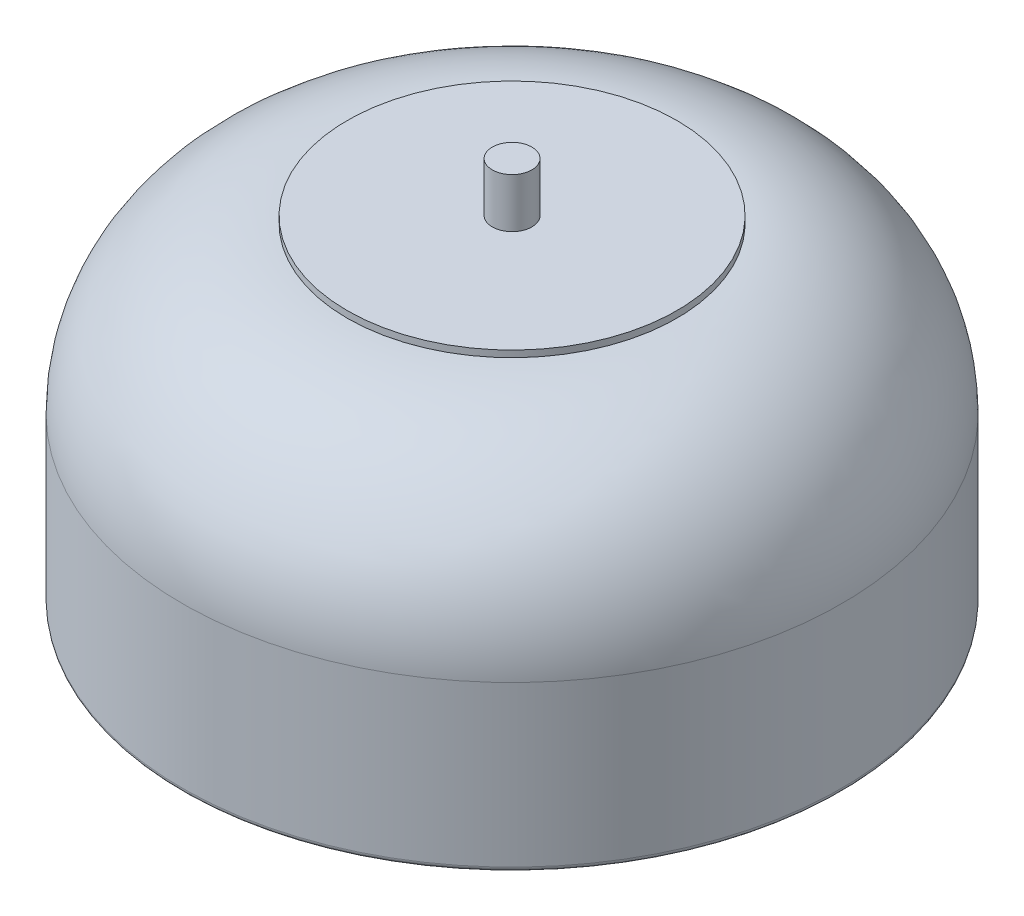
ISO-10303-21;
HEADER;
FILE_DESCRIPTION(('STEP AP214'),'2;1');
FILE_NAME('part.step','',(''),(''),'','','');
FILE_SCHEMA(('AUTOMOTIVE_DESIGN { 1 0 10303 214 1 1 1 1 }'));
ENDSEC;
DATA;
#1=APPLICATION_CONTEXT('core data for automotive mechanical design processes');
#2=APPLICATION_PROTOCOL_DEFINITION('international standard','automotive_design',2000,#1);
#3=PRODUCT_CONTEXT('',#1,'mechanical');
#4=PRODUCT('Part','Part','',(#3));
#5=PRODUCT_RELATED_PRODUCT_CATEGORY('part','',(#4));
#6=PRODUCT_DEFINITION_FORMATION('','',#4);
#7=PRODUCT_DEFINITION_CONTEXT('part definition',#1,'design');
#8=PRODUCT_DEFINITION('design','',#6,#7);
#9=PRODUCT_DEFINITION_SHAPE('','',#8);
#10=(LENGTH_UNIT() NAMED_UNIT(*) SI_UNIT(.MILLI.,.METRE.));
#11=(NAMED_UNIT(*) PLANE_ANGLE_UNIT() SI_UNIT($,.RADIAN.));
#12=(NAMED_UNIT(*) SI_UNIT($,.STERADIAN.) SOLID_ANGLE_UNIT());
#13=UNCERTAINTY_MEASURE_WITH_UNIT(LENGTH_MEASURE(1.E-05),#10,'distance_accuracy_value','');
#14=(GEOMETRIC_REPRESENTATION_CONTEXT(3) GLOBAL_UNCERTAINTY_ASSIGNED_CONTEXT((#13)) GLOBAL_UNIT_ASSIGNED_CONTEXT((#10,
#11,#12)) REPRESENTATION_CONTEXT('',''));
#15=CARTESIAN_POINT('',(0.,0.,0.));
#16=DIRECTION('',(0.,0.,1.));
#17=DIRECTION('',(1.,0.,0.));
#18=AXIS2_PLACEMENT_3D('',#15,#16,#17);
#19=CARTESIAN_POINT('',(0.,32.,0.));
#20=DIRECTION('',(0.,-1.,0.));
#21=DIRECTION('',(0.,0.,-1.));
#22=AXIS2_PLACEMENT_3D('',#19,#20,#21);
#23=CYLINDRICAL_SURFACE('',#22,50.);
#24=CARTESIAN_POINT('',(0.,32.,0.));
#25=DIRECTION('',(0.,1.,0.));
#26=DIRECTION('',(0.,0.,1.));
#27=AXIS2_PLACEMENT_3D('',#24,#25,#26);
#28=CIRCLE('',#27,50.);
#29=CARTESIAN_POINT('',(0.,32.,50.));
#30=VERTEX_POINT('',#29);
#31=EDGE_CURVE('E11',#30,#30,#28,.T.);
#32=ORIENTED_EDGE('',*,*,#31,.F.);
#33=EDGE_LOOP('',(#32));
#34=FACE_BOUND('',#33,.T.);
#35=CARTESIAN_POINT('',(0.,30.,0.));
#36=DIRECTION('',(0.,1.,0.));
#37=DIRECTION('',(0.,0.,1.));
#38=AXIS2_PLACEMENT_3D('',#35,#36,#37);
#39=CIRCLE('',#38,50.);
#40=CARTESIAN_POINT('',(0.,30.,50.));
#41=VERTEX_POINT('',#40);
#42=EDGE_CURVE('E43',#41,#41,#39,.T.);
#43=ORIENTED_EDGE('',*,*,#42,.T.);
#44=EDGE_LOOP('',(#43));
#45=FACE_BOUND('',#44,.T.);
#46=ADVANCED_FACE('F40',(#34,#45),#23,.T.);
#47=CARTESIAN_POINT('',(0.,32.,0.));
#48=DIRECTION('',(0.,1.,0.));
#49=DIRECTION('',(0.,0.,1.));
#50=AXIS2_PLACEMENT_3D('',#47,#48,#49);
#51=PLANE('',#50);
#52=CARTESIAN_POINT('',(0.,32.,0.));
#53=DIRECTION('',(0.,1.,0.));
#54=DIRECTION('',(0.,0.,1.));
#55=AXIS2_PLACEMENT_3D('',#52,#53,#54);
#56=CIRCLE('',#55,6.);
#57=CARTESIAN_POINT('',(0.,32.,6.));
#58=VERTEX_POINT('',#57);
#59=EDGE_CURVE('E52',#58,#58,#56,.T.);
#60=ORIENTED_EDGE('',*,*,#59,.F.);
#61=EDGE_LOOP('',(#60));
#62=FACE_BOUND('',#61,.T.);
#63=ORIENTED_EDGE('',*,*,#31,.T.);
#64=EDGE_LOOP('',(#63));
#65=FACE_BOUND('',#64,.T.);
#66=ADVANCED_FACE('F67',(#62,#65),#51,.T.);
#67=CARTESIAN_POINT('',(0.,30.,0.));
#68=DIRECTION('',(0.,1.,0.));
#69=DIRECTION('',(0.,0.,1.));
#70=AXIS2_PLACEMENT_3D('',#67,#68,#69);
#71=PLANE('',#70);
#72=ORIENTED_EDGE('',*,*,#42,.F.);
#73=EDGE_LOOP('',(#72));
#74=FACE_BOUND('',#73,.T.);
#75=ADVANCED_FACE('F63',(#74),#71,.F.);
#76=CARTESIAN_POINT('',(0.,47.,0.));
#77=DIRECTION('',(0.,-1.,0.));
#78=DIRECTION('',(0.,0.,-1.));
#79=AXIS2_PLACEMENT_3D('',#76,#77,#78);
#80=CYLINDRICAL_SURFACE('',#79,6.);
#81=CARTESIAN_POINT('',(0.,47.,0.));
#82=DIRECTION('',(0.,1.,0.));
#83=DIRECTION('',(0.,0.,1.));
#84=AXIS2_PLACEMENT_3D('',#81,#82,#83);
#85=CIRCLE('',#84,6.);
#86=CARTESIAN_POINT('',(0.,47.,6.));
#87=VERTEX_POINT('',#86);
#88=EDGE_CURVE('E50',#87,#87,#85,.T.);
#89=ORIENTED_EDGE('',*,*,#88,.F.);
#90=EDGE_LOOP('',(#89));
#91=FACE_BOUND('',#90,.T.);
#92=ORIENTED_EDGE('',*,*,#59,.T.);
#93=EDGE_LOOP('',(#92));
#94=FACE_BOUND('',#93,.T.);
#95=ADVANCED_FACE('F60',(#91,#94),#80,.T.);
#96=CARTESIAN_POINT('',(0.,47.,0.));
#97=DIRECTION('',(0.,1.,0.));
#98=DIRECTION('',(0.,0.,1.));
#99=AXIS2_PLACEMENT_3D('',#96,#97,#98);
#100=PLANE('',#99);
#101=ORIENTED_EDGE('',*,*,#88,.T.);
#102=EDGE_LOOP('',(#101));
#103=FACE_BOUND('',#102,.T.);
#104=ADVANCED_FACE('F58',(#103),#100,.T.);
#105=CLOSED_SHELL('',(#46,#66,#75,#95,#104));
#106=MANIFOLD_SOLID_BREP('B2',#105);
#107=CARTESIAN_POINT('',(0.,-10.,0.));
#108=DIRECTION('',(0.,1.,0.));
#109=DIRECTION('',(0.,0.,1.));
#110=AXIS2_PLACEMENT_3D('',#107,#108,#109);
#111=CYLINDRICAL_SURFACE('',#110,50.);
#112=CARTESIAN_POINT('',(0.,0.,0.));
#113=DIRECTION('',(0.,-1.,0.));
#114=DIRECTION('',(0.,0.,-1.));
#115=AXIS2_PLACEMENT_3D('',#112,#113,#114);
#116=CIRCLE('',#115,50.);
#117=CARTESIAN_POINT('',(0.,0.,-50.));
#118=VERTEX_POINT('',#117);
#119=EDGE_CURVE('E39',#118,#118,#116,.F.);
#120=ORIENTED_EDGE('',*,*,#119,.T.);
#121=EDGE_LOOP('',(#120));
#122=FACE_BOUND('',#121,.T.);
#123=CARTESIAN_POINT('',(0.,5.,0.));
#124=DIRECTION('',(0.,-1.,0.));
#125=DIRECTION('',(0.,0.,-1.));
#126=AXIS2_PLACEMENT_3D('',#123,#124,#125);
#127=CIRCLE('',#126,50.);
#128=CARTESIAN_POINT('',(0.,5.,-50.));
#129=VERTEX_POINT('',#128);
#130=EDGE_CURVE('E130',#129,#129,#127,.T.);
#131=ORIENTED_EDGE('',*,*,#130,.T.);
#132=EDGE_LOOP('',(#131));
#133=FACE_BOUND('',#132,.T.);
#134=ADVANCED_FACE('F119',(#122,#133),#111,.T.);
#135=CARTESIAN_POINT('',(0.,-10.,0.));
#136=DIRECTION('',(0.,-1.,0.));
#137=DIRECTION('',(0.,0.,-1.));
#138=AXIS2_PLACEMENT_3D('',#135,#136,#137);
#139=PLANE('',#138);
#140=CARTESIAN_POINT('',(0.,-10.,0.));
#141=DIRECTION('',(0.,-1.,0.));
#142=DIRECTION('',(0.,0.,-1.));
#143=AXIS2_PLACEMENT_3D('',#140,#141,#142);
#144=CIRCLE('',#143,40.);
#145=CARTESIAN_POINT('',(0.,-10.,-40.));
#146=VERTEX_POINT('',#145);
#147=EDGE_CURVE('E126',#146,#146,#144,.T.);
#148=ORIENTED_EDGE('',*,*,#147,.T.);
#149=EDGE_LOOP('',(#148));
#150=FACE_BOUND('',#149,.T.);
#151=ADVANCED_FACE('F140',(#150),#139,.T.);
#152=CARTESIAN_POINT('',(0.,5.,0.));
#153=DIRECTION('',(0.,-1.,0.));
#154=DIRECTION('',(0.,0.,-1.));
#155=AXIS2_PLACEMENT_3D('',#152,#153,#154);
#156=PLANE('',#155);
#157=ORIENTED_EDGE('',*,*,#130,.F.);
#158=EDGE_LOOP('',(#157));
#159=FACE_BOUND('',#158,.T.);
#160=ADVANCED_FACE('F138',(#159),#156,.F.);
#161=CARTESIAN_POINT('',(0.,0.,0.));
#162=DIRECTION('',(0.,-1.,0.));
#163=DIRECTION('',(0.,0.,-1.));
#164=AXIS2_PLACEMENT_3D('',#161,#162,#163);
#165=TOROIDAL_SURFACE('',#164,40.,10.);
#166=ORIENTED_EDGE('',*,*,#119,.F.);
#167=EDGE_LOOP('',(#166));
#168=FACE_BOUND('',#167,.T.);
#169=ORIENTED_EDGE('',*,*,#147,.F.);
#170=EDGE_LOOP('',(#169));
#171=FACE_BOUND('',#170,.T.);
#172=ADVANCED_FACE('F121',(#168,#171),#165,.T.);
#173=CLOSED_SHELL('',(#134,#151,#160,#172));
#174=MANIFOLD_SOLID_BREP('B6',#173);
#175=CARTESIAN_POINT('',(0.,5.,0.));
#176=DIRECTION('',(0.,1.,0.));
#177=DIRECTION('',(0.,0.,1.));
#178=AXIS2_PLACEMENT_3D('',#175,#176,#177);
#179=CYLINDRICAL_SURFACE('',#178,50.);
#180=CARTESIAN_POINT('',(0.,5.,0.));
#181=DIRECTION('',(0.,-1.,0.));
#182=DIRECTION('',(0.,0.,-1.));
#183=AXIS2_PLACEMENT_3D('',#180,#181,#182);
#184=CIRCLE('',#183,50.);
#185=CARTESIAN_POINT('',(0.,5.,-50.));
#186=VERTEX_POINT('',#185);
#187=EDGE_CURVE('E118',#186,#186,#184,.T.);
#188=ORIENTED_EDGE('',*,*,#187,.F.);
#189=EDGE_LOOP('',(#188));
#190=FACE_BOUND('',#189,.T.);
#191=CARTESIAN_POINT('',(0.,25.,0.));
#192=DIRECTION('',(0.,-1.,0.));
#193=DIRECTION('',(0.,0.,-1.));
#194=AXIS2_PLACEMENT_3D('',#191,#192,#193);
#195=CIRCLE('',#194,50.);
#196=CARTESIAN_POINT('',(0.,25.,-50.));
#197=VERTEX_POINT('',#196);
#198=EDGE_CURVE('E186',#197,#197,#195,.T.);
#199=ORIENTED_EDGE('',*,*,#198,.T.);
#200=EDGE_LOOP('',(#199));
#201=FACE_BOUND('',#200,.T.);
#202=ADVANCED_FACE('F183',(#190,#201),#179,.T.);
#203=CARTESIAN_POINT('',(0.,5.,0.));
#204=DIRECTION('',(0.,-1.,0.));
#205=DIRECTION('',(0.,0.,-1.));
#206=AXIS2_PLACEMENT_3D('',#203,#204,#205);
#207=PLANE('',#206);
#208=ORIENTED_EDGE('',*,*,#187,.T.);
#209=EDGE_LOOP('',(#208));
#210=FACE_BOUND('',#209,.T.);
#211=ADVANCED_FACE('F198',(#210),#207,.T.);
#212=CARTESIAN_POINT('',(0.,25.,0.));
#213=DIRECTION('',(0.,-1.,0.));
#214=DIRECTION('',(0.,0.,-1.));
#215=AXIS2_PLACEMENT_3D('',#212,#213,#214);
#216=PLANE('',#215);
#217=ORIENTED_EDGE('',*,*,#198,.F.);
#218=EDGE_LOOP('',(#217));
#219=FACE_BOUND('',#218,.T.);
#220=ADVANCED_FACE('F196',(#219),#216,.F.);
#221=CLOSED_SHELL('',(#202,#211,#220));
#222=MANIFOLD_SOLID_BREP('B34',#221);
#223=CARTESIAN_POINT('',(0.,25.,0.));
#224=DIRECTION('',(0.,1.,0.));
#225=DIRECTION('',(0.,0.,1.));
#226=AXIS2_PLACEMENT_3D('',#223,#224,#225);
#227=CYLINDRICAL_SURFACE('',#226,50.);
#228=CARTESIAN_POINT('',(0.,25.,0.));
#229=DIRECTION('',(0.,-1.,0.));
#230=DIRECTION('',(0.,0.,-1.));
#231=AXIS2_PLACEMENT_3D('',#228,#229,#230);
#232=CIRCLE('',#231,50.);
#233=CARTESIAN_POINT('',(0.,25.,-50.));
#234=VERTEX_POINT('',#233);
#235=EDGE_CURVE('E182',#234,#234,#232,.T.);
#236=ORIENTED_EDGE('',*,*,#235,.F.);
#237=EDGE_LOOP('',(#236));
#238=FACE_BOUND('',#237,.T.);
#239=CARTESIAN_POINT('',(0.,27.,0.));
#240=DIRECTION('',(0.,-1.,0.));
#241=DIRECTION('',(0.,0.,-1.));
#242=AXIS2_PLACEMENT_3D('',#239,#240,#241);
#243=CIRCLE('',#242,50.);
#244=CARTESIAN_POINT('',(0.,27.,-50.));
#245=VERTEX_POINT('',#244);
#246=EDGE_CURVE('E234',#245,#245,#243,.T.);
#247=ORIENTED_EDGE('',*,*,#246,.T.);
#248=EDGE_LOOP('',(#247));
#249=FACE_BOUND('',#248,.T.);
#250=ADVANCED_FACE('F231',(#238,#249),#227,.T.);
#251=CARTESIAN_POINT('',(0.,25.,0.));
#252=DIRECTION('',(0.,-1.,0.));
#253=DIRECTION('',(0.,0.,-1.));
#254=AXIS2_PLACEMENT_3D('',#251,#252,#253);
#255=PLANE('',#254);
#256=ORIENTED_EDGE('',*,*,#235,.T.);
#257=EDGE_LOOP('',(#256));
#258=FACE_BOUND('',#257,.T.);
#259=ADVANCED_FACE('F246',(#258),#255,.T.);
#260=CARTESIAN_POINT('',(0.,27.,0.));
#261=DIRECTION('',(0.,-1.,0.));
#262=DIRECTION('',(0.,0.,-1.));
#263=AXIS2_PLACEMENT_3D('',#260,#261,#262);
#264=PLANE('',#263);
#265=ORIENTED_EDGE('',*,*,#246,.F.);
#266=EDGE_LOOP('',(#265));
#267=FACE_BOUND('',#266,.T.);
#268=ADVANCED_FACE('F244',(#267),#264,.F.);
#269=CLOSED_SHELL('',(#250,#259,#268));
#270=MANIFOLD_SOLID_BREP('B113',#269);
#271=CARTESIAN_POINT('',(50.,30.,0.));
#272=DIRECTION('',(0.,-1.,0.));
#273=DIRECTION('',(1.,0.,0.));
#274=AXIS2_PLACEMENT_3D('',#271,#272,#273);
#275=PLANE('',#274);
#276=CARTESIAN_POINT('',(0.,30.,0.));
#277=DIRECTION('',(0.,1.,0.));
#278=DIRECTION('',(-1.,0.,0.));
#279=AXIS2_PLACEMENT_3D('',#276,#277,#278);
#280=CIRCLE('',#279,50.);
#281=CARTESIAN_POINT('',(-50.,30.,0.));
#282=VERTEX_POINT('',#281);
#283=EDGE_CURVE('E284',#282,#282,#280,.T.);
#284=ORIENTED_EDGE('',*,*,#283,.T.);
#285=EDGE_LOOP('',(#284));
#286=FACE_BOUND('',#285,.T.);
#287=ADVANCED_FACE('F272',(#286),#275,.F.);
#288=CARTESIAN_POINT('',(0.,-20.,0.));
#289=DIRECTION('',(0.,1.,0.));
#290=DIRECTION('',(-1.,0.,0.));
#291=AXIS2_PLACEMENT_3D('',#288,#289,#290);
#292=DEGENERATE_TOROIDAL_SURFACE('',#291,50.,50.,.T.);
#293=ORIENTED_EDGE('',*,*,#283,.F.);
#294=EDGE_LOOP('',(#293));
#295=FACE_BOUND('',#294,.T.);
#296=CARTESIAN_POINT('',(0.,-20.,0.));
#297=DIRECTION('',(0.,1.,0.));
#298=DIRECTION('',(-1.,0.,0.));
#299=AXIS2_PLACEMENT_3D('',#296,#297,#298);
#300=CIRCLE('',#299,100.);
#301=CARTESIAN_POINT('',(-100.,-20.,0.));
#302=VERTEX_POINT('',#301);
#303=EDGE_CURVE('E289',#302,#302,#300,.T.);
#304=ORIENTED_EDGE('',*,*,#303,.T.);
#305=EDGE_LOOP('',(#304));
#306=FACE_BOUND('',#305,.T.);
#307=ADVANCED_FACE('F312',(#295,#306),#292,.T.);
#308=CARTESIAN_POINT('',(0.,30.,0.));
#309=DIRECTION('',(0.,1.,0.));
#310=DIRECTION('',(-1.,0.,0.));
#311=AXIS2_PLACEMENT_3D('',#308,#309,#310);
#312=CYLINDRICAL_SURFACE('',#311,100.);
#313=CARTESIAN_POINT('',(0.,-68.5,0.));
#314=DIRECTION('',(0.,1.,0.));
#315=DIRECTION('',(-1.,0.,0.));
#316=AXIS2_PLACEMENT_3D('',#313,#314,#315);
#317=CIRCLE('',#316,100.);
#318=CARTESIAN_POINT('',(-100.,-68.5,0.));
#319=VERTEX_POINT('',#318);
#320=EDGE_CURVE('E280',#319,#319,#317,.T.);
#321=ORIENTED_EDGE('',*,*,#320,.T.);
#322=EDGE_LOOP('',(#321));
#323=FACE_BOUND('',#322,.T.);
#324=ORIENTED_EDGE('',*,*,#303,.F.);
#325=EDGE_LOOP('',(#324));
#326=FACE_BOUND('',#325,.T.);
#327=ADVANCED_FACE('F304',(#323,#326),#312,.T.);
#328=CARTESIAN_POINT('',(50.,27.,0.));
#329=DIRECTION('',(0.,-1.,0.));
#330=DIRECTION('',(1.,0.,0.));
#331=AXIS2_PLACEMENT_3D('',#328,#329,#330);
#332=PLANE('',#331);
#333=CARTESIAN_POINT('',(0.,27.,0.));
#334=DIRECTION('',(0.,1.,0.));
#335=DIRECTION('',(-1.,0.,0.));
#336=AXIS2_PLACEMENT_3D('',#333,#334,#335);
#337=CIRCLE('',#336,50.);
#338=CARTESIAN_POINT('',(-50.,27.,0.));
#339=VERTEX_POINT('',#338);
#340=EDGE_CURVE('E292',#339,#339,#337,.T.);
#341=ORIENTED_EDGE('',*,*,#340,.F.);
#342=EDGE_LOOP('',(#341));
#343=FACE_BOUND('',#342,.T.);
#344=ADVANCED_FACE('F302',(#343),#332,.T.);
#345=CARTESIAN_POINT('',(0.,-20.,0.));
#346=DIRECTION('',(0.,1.,0.));
#347=DIRECTION('',(-1.,0.,0.));
#348=AXIS2_PLACEMENT_3D('',#345,#346,#347);
#349=TOROIDAL_SURFACE('',#348,50.,47.);
#350=ORIENTED_EDGE('',*,*,#340,.T.);
#351=EDGE_LOOP('',(#350));
#352=FACE_BOUND('',#351,.T.);
#353=CARTESIAN_POINT('',(0.,-20.,0.));
#354=DIRECTION('',(0.,1.,0.));
#355=DIRECTION('',(-1.,0.,0.));
#356=AXIS2_PLACEMENT_3D('',#353,#354,#355);
#357=CIRCLE('',#356,97.);
#358=CARTESIAN_POINT('',(-97.,-20.,0.));
#359=VERTEX_POINT('',#358);
#360=EDGE_CURVE('E293',#359,#359,#357,.T.);
#361=ORIENTED_EDGE('',*,*,#360,.F.);
#362=EDGE_LOOP('',(#361));
#363=FACE_BOUND('',#362,.T.);
#364=ADVANCED_FACE('F299',(#352,#363),#349,.F.);
#365=CARTESIAN_POINT('',(0.,30.,0.));
#366=DIRECTION('',(0.,1.,0.));
#367=DIRECTION('',(-1.,0.,0.));
#368=AXIS2_PLACEMENT_3D('',#365,#366,#367);
#369=CYLINDRICAL_SURFACE('',#368,97.);
#370=CARTESIAN_POINT('',(0.,-68.5,0.));
#371=DIRECTION('',(0.,1.,0.));
#372=DIRECTION('',(-1.,0.,0.));
#373=AXIS2_PLACEMENT_3D('',#370,#371,#372);
#374=CIRCLE('',#373,97.);
#375=CARTESIAN_POINT('',(-97.,-68.5,0.));
#376=VERTEX_POINT('',#375);
#377=EDGE_CURVE('E230',#376,#376,#374,.F.);
#378=ORIENTED_EDGE('',*,*,#377,.T.);
#379=EDGE_LOOP('',(#378));
#380=FACE_BOUND('',#379,.T.);
#381=ORIENTED_EDGE('',*,*,#360,.T.);
#382=EDGE_LOOP('',(#381));
#383=FACE_BOUND('',#382,.T.);
#384=ADVANCED_FACE('F310',(#380,#383),#369,.F.);
#385=CARTESIAN_POINT('',(0.,-68.5,0.));
#386=DIRECTION('',(0.,1.,0.));
#387=DIRECTION('',(-1.,0.,0.));
#388=AXIS2_PLACEMENT_3D('',#385,#386,#387);
#389=TOROIDAL_SURFACE('',#388,98.5,1.5);
#390=ORIENTED_EDGE('',*,*,#377,.F.);
#391=EDGE_LOOP('',(#390));
#392=FACE_BOUND('',#391,.T.);
#393=CARTESIAN_POINT('',(0.,-70.,0.));
#394=DIRECTION('',(0.,1.,0.));
#395=DIRECTION('',(-1.,0.,0.));
#396=AXIS2_PLACEMENT_3D('',#393,#394,#395);
#397=CIRCLE('',#396,98.5);
#398=CARTESIAN_POINT('',(-98.5,-70.,0.));
#399=VERTEX_POINT('',#398);
#400=EDGE_CURVE('E276',#399,#399,#397,.T.);
#401=ORIENTED_EDGE('',*,*,#400,.F.);
#402=EDGE_LOOP('',(#401));
#403=FACE_BOUND('',#402,.T.);
#404=ADVANCED_FACE('F274',(#392,#403),#389,.T.);
#405=CARTESIAN_POINT('',(0.,-68.5,0.));
#406=DIRECTION('',(0.,1.,0.));
#407=DIRECTION('',(-1.,0.,0.));
#408=AXIS2_PLACEMENT_3D('',#405,#406,#407);
#409=TOROIDAL_SURFACE('',#408,98.5,1.5);
#410=ORIENTED_EDGE('',*,*,#400,.T.);
#411=EDGE_LOOP('',(#410));
#412=FACE_BOUND('',#411,.T.);
#413=ORIENTED_EDGE('',*,*,#320,.F.);
#414=EDGE_LOOP('',(#413));
#415=FACE_BOUND('',#414,.T.);
#416=ADVANCED_FACE('F323',(#412,#415),#409,.T.);
#417=CLOSED_SHELL('',(#287,#307,#327,#344,#364,#384,#404,#416));
#418=MANIFOLD_SOLID_BREP('B177',#417);
#419=ADVANCED_BREP_SHAPE_REPRESENTATION('',(#18,#106,#174,#222,#270,#418),#14);
#420=SHAPE_DEFINITION_REPRESENTATION(#9,#419);
ENDSEC;
END-ISO-10303-21;
